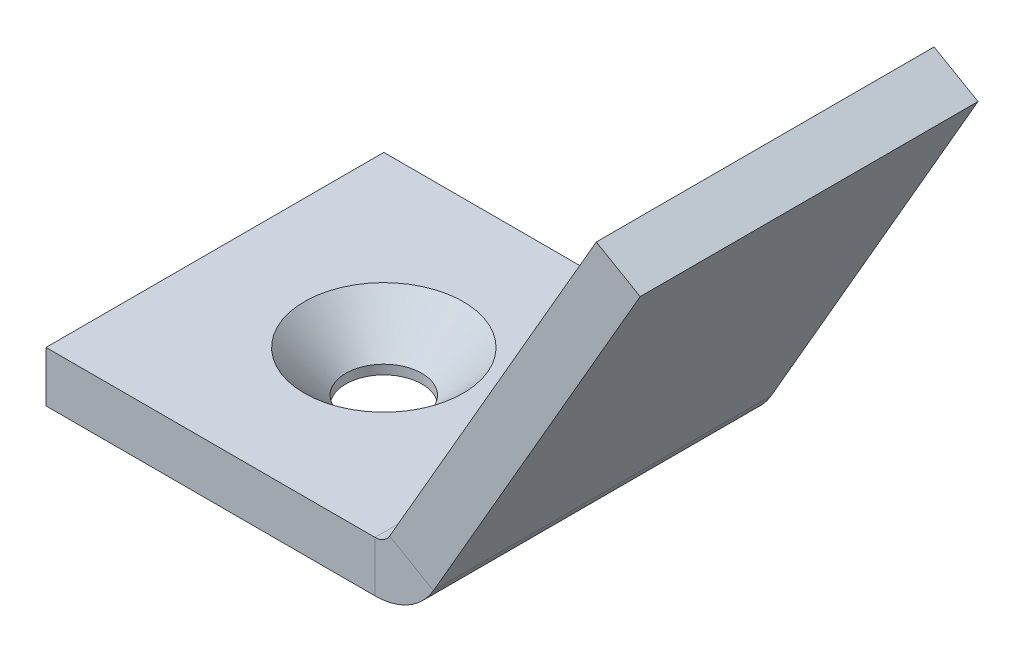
ISO-10303-21;
HEADER;
FILE_DESCRIPTION(('STEP AP214'),'2;1');
FILE_NAME('part.step','',(''),(''),'','','');
FILE_SCHEMA(('AUTOMOTIVE_DESIGN { 1 0 10303 214 1 1 1 1 }'));
ENDSEC;
DATA;
#1=APPLICATION_CONTEXT('core data for automotive mechanical design processes');
#2=APPLICATION_PROTOCOL_DEFINITION('international standard','automotive_design',2000,#1);
#3=PRODUCT_CONTEXT('',#1,'mechanical');
#4=PRODUCT('Part','Part','',(#3));
#5=PRODUCT_RELATED_PRODUCT_CATEGORY('part','',(#4));
#6=PRODUCT_DEFINITION_FORMATION('','',#4);
#7=PRODUCT_DEFINITION_CONTEXT('part definition',#1,'design');
#8=PRODUCT_DEFINITION('design','',#6,#7);
#9=PRODUCT_DEFINITION_SHAPE('','',#8);
#10=(LENGTH_UNIT() NAMED_UNIT(*) SI_UNIT(.MILLI.,.METRE.));
#11=(NAMED_UNIT(*) PLANE_ANGLE_UNIT() SI_UNIT($,.RADIAN.));
#12=(NAMED_UNIT(*) SI_UNIT($,.STERADIAN.) SOLID_ANGLE_UNIT());
#13=UNCERTAINTY_MEASURE_WITH_UNIT(LENGTH_MEASURE(1.E-05),#10,'distance_accuracy_value','');
#14=(GEOMETRIC_REPRESENTATION_CONTEXT(3) GLOBAL_UNCERTAINTY_ASSIGNED_CONTEXT((#13)) GLOBAL_UNIT_ASSIGNED_CONTEXT((#10,
#11,#12)) REPRESENTATION_CONTEXT('',''));
#15=CARTESIAN_POINT('',(0.,0.,0.));
#16=DIRECTION('',(0.,0.,1.));
#17=DIRECTION('',(1.,0.,0.));
#18=AXIS2_PLACEMENT_3D('',#15,#16,#17);
#19=CARTESIAN_POINT('',(10.0806036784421,-14.2739715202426,-20.));
#20=DIRECTION('',(0.86602540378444,-0.499999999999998,0.));
#21=DIRECTION('',(0.,0.,-1.));
#22=AXIS2_PLACEMENT_3D('',#19,#20,#21);
#23=PLANE('',#22);
#24=DIRECTION('',(-0.499999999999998,-0.86602540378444,0.));
#25=VECTOR('',#24,1.);
#26=CARTESIAN_POINT('',(10.0806036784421,-14.2739715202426,-20.));
#27=LINE('',#26,#25);
#28=CARTESIAN_POINT('',(32.580603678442,24.6971716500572,-20.));
#29=VERTEX_POINT('',#28);
#30=CARTESIAN_POINT('',(20.3424109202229,3.5,-20.));
#31=VERTEX_POINT('',#30);
#32=EDGE_CURVE('E41',#29,#31,#27,.T.);
#33=ORIENTED_EDGE('',*,*,#32,.T.);
#34=DIRECTION('',(0.,0.,1.));
#35=VECTOR('',#34,1.);
#36=CARTESIAN_POINT('',(20.3424109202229,3.50000000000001,-20.));
#37=LINE('',#36,#35);
#38=CARTESIAN_POINT('',(20.3424109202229,3.49999999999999,0.));
#39=VERTEX_POINT('',#38);
#40=EDGE_CURVE('E103',#31,#39,#37,.T.);
#41=ORIENTED_EDGE('',*,*,#40,.T.);
#42=DIRECTION('',(0.499999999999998,0.86602540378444,0.));
#43=VECTOR('',#42,1.);
#44=CARTESIAN_POINT('',(10.0806036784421,-14.2739715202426,0.));
#45=LINE('',#44,#43);
#46=CARTESIAN_POINT('',(32.580603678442,24.6971716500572,0.));
#47=VERTEX_POINT('',#46);
#48=EDGE_CURVE('E95',#39,#47,#45,.T.);
#49=ORIENTED_EDGE('',*,*,#48,.T.);
#50=DIRECTION('',(0.,0.,-1.));
#51=VECTOR('',#50,1.);
#52=CARTESIAN_POINT('',(32.580603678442,24.6971716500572,0.));
#53=LINE('',#52,#51);
#54=EDGE_CURVE('E62',#47,#29,#53,.T.);
#55=ORIENTED_EDGE('',*,*,#54,.T.);
#56=EDGE_LOOP('',(#33,#41,#49,#55));
#57=FACE_BOUND('',#56,.T.);
#58=ADVANCED_FACE('F37',(#57),#23,.F.);
#59=CARTESIAN_POINT('',(10.0806036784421,-14.2739715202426,-20.));
#60=DIRECTION('',(0.,0.,1.));
#61=DIRECTION('',(0.499999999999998,0.86602540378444,0.));
#62=AXIS2_PLACEMENT_3D('',#59,#60,#61);
#63=PLANE('',#62);
#64=DIRECTION('',(-0.499999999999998,-0.86602540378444,0.));
#65=VECTOR('',#64,1.);
#66=CARTESIAN_POINT('',(12.6786798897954,-15.7739715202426,-20.));
#67=LINE('',#66,#65);
#68=CARTESIAN_POINT('',(35.1786798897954,23.1971716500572,-20.));
#69=VERTEX_POINT('',#68);
#70=CARTESIAN_POINT('',(22.9404871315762,2.,-20.));
#71=VERTEX_POINT('',#70);
#72=EDGE_CURVE('E85',#69,#71,#67,.T.);
#73=ORIENTED_EDGE('',*,*,#72,.T.);
#74=DIRECTION('',(-0.86602540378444,0.499999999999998,0.));
#75=VECTOR('',#74,1.);
#76=CARTESIAN_POINT('',(20.3424109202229,3.50000000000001,-20.));
#77=LINE('',#76,#75);
#78=EDGE_CURVE('E101',#71,#31,#77,.T.);
#79=ORIENTED_EDGE('',*,*,#78,.T.);
#80=ORIENTED_EDGE('',*,*,#32,.F.);
#81=DIRECTION('',(0.86602540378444,-0.499999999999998,0.));
#82=VECTOR('',#81,1.);
#83=CARTESIAN_POINT('',(32.580603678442,24.6971716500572,-20.));
#84=LINE('',#83,#82);
#85=EDGE_CURVE('E78',#29,#69,#84,.T.);
#86=ORIENTED_EDGE('',*,*,#85,.T.);
#87=EDGE_LOOP('',(#73,#79,#80,#86));
#88=FACE_BOUND('',#87,.T.);
#89=ADVANCED_FACE('F90',(#88),#63,.F.);
#90=CARTESIAN_POINT('',(10.0806036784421,-14.2739715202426,0.));
#91=DIRECTION('',(0.,0.,-1.));
#92=DIRECTION('',(-0.499999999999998,-0.86602540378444,0.));
#93=AXIS2_PLACEMENT_3D('',#90,#91,#92);
#94=PLANE('',#93);
#95=ORIENTED_EDGE('',*,*,#48,.F.);
#96=DIRECTION('',(0.86602540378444,-0.499999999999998,0.));
#97=VECTOR('',#96,1.);
#98=CARTESIAN_POINT('',(20.3424109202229,3.50000000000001,0.));
#99=LINE('',#98,#97);
#100=CARTESIAN_POINT('',(22.9404871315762,2.00000000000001,0.));
#101=VERTEX_POINT('',#100);
#102=EDGE_CURVE('E12',#39,#101,#99,.T.);
#103=ORIENTED_EDGE('',*,*,#102,.T.);
#104=DIRECTION('',(0.499999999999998,0.86602540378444,0.));
#105=VECTOR('',#104,1.);
#106=CARTESIAN_POINT('',(12.6786798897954,-15.7739715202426,0.));
#107=LINE('',#106,#105);
#108=CARTESIAN_POINT('',(35.1786798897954,23.1971716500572,0.));
#109=VERTEX_POINT('',#108);
#110=EDGE_CURVE('E86',#101,#109,#107,.T.);
#111=ORIENTED_EDGE('',*,*,#110,.T.);
#112=DIRECTION('',(0.86602540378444,-0.499999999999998,0.));
#113=VECTOR('',#112,1.);
#114=CARTESIAN_POINT('',(32.580603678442,24.6971716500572,0.));
#115=LINE('',#114,#113);
#116=EDGE_CURVE('E81',#47,#109,#115,.T.);
#117=ORIENTED_EDGE('',*,*,#116,.F.);
#118=EDGE_LOOP('',(#95,#103,#111,#117));
#119=FACE_BOUND('',#118,.T.);
#120=ADVANCED_FACE('F39',(#119),#94,.F.);
#121=CARTESIAN_POINT('',(12.6786798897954,-15.7739715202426,-20.));
#122=DIRECTION('',(0.86602540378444,-0.499999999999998,0.));
#123=DIRECTION('',(0.,0.,-1.));
#124=AXIS2_PLACEMENT_3D('',#121,#122,#123);
#125=PLANE('',#124);
#126=DIRECTION('',(0.,0.,1.));
#127=VECTOR('',#126,1.);
#128=CARTESIAN_POINT('',(22.9404871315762,2.00000000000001,-20.));
#129=LINE('',#128,#127);
#130=EDGE_CURVE('E46',#71,#101,#129,.T.);
#131=ORIENTED_EDGE('',*,*,#130,.F.);
#132=ORIENTED_EDGE('',*,*,#72,.F.);
#133=DIRECTION('',(0.,0.,-1.));
#134=VECTOR('',#133,1.);
#135=CARTESIAN_POINT('',(35.1786798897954,23.1971716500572,0.));
#136=LINE('',#135,#134);
#137=EDGE_CURVE('E75',#109,#69,#136,.T.);
#138=ORIENTED_EDGE('',*,*,#137,.F.);
#139=ORIENTED_EDGE('',*,*,#110,.F.);
#140=EDGE_LOOP('',(#131,#132,#138,#139));
#141=FACE_BOUND('',#140,.T.);
#142=ADVANCED_FACE('F94',(#141),#125,.T.);
#143=CARTESIAN_POINT('',(32.580603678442,24.6971716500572,0.));
#144=DIRECTION('',(-0.499999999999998,-0.86602540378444,0.));
#145=DIRECTION('',(0.,0.,1.));
#146=AXIS2_PLACEMENT_3D('',#143,#144,#145);
#147=PLANE('',#146);
#148=ORIENTED_EDGE('',*,*,#137,.T.);
#149=ORIENTED_EDGE('',*,*,#85,.F.);
#150=ORIENTED_EDGE('',*,*,#54,.F.);
#151=ORIENTED_EDGE('',*,*,#116,.T.);
#152=EDGE_LOOP('',(#148,#149,#150,#151));
#153=FACE_BOUND('',#152,.T.);
#154=ADVANCED_FACE('F77',(#153),#147,.F.);
#155=CARTESIAN_POINT('',(10.,3.,-10.));
#156=DIRECTION('',(0.,1.,0.));
#157=DIRECTION('',(0.,0.,1.));
#158=AXIS2_PLACEMENT_3D('',#155,#156,#157);
#159=CYLINDRICAL_SURFACE('',#158,2.24999999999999);
#160=CARTESIAN_POINT('',(10.,0.,-10.));
#161=DIRECTION('',(0.,1.,0.));
#162=DIRECTION('',(0.,0.,1.));
#163=AXIS2_PLACEMENT_3D('',#160,#161,#162);
#164=CIRCLE('',#163,2.25);
#165=CARTESIAN_POINT('',(10.,0.,-7.75000000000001));
#166=VERTEX_POINT('',#165);
#167=EDGE_CURVE('E142',#166,#166,#164,.T.);
#168=ORIENTED_EDGE('',*,*,#167,.F.);
#169=EDGE_LOOP('',(#168));
#170=FACE_BOUND('',#169,.T.);
#171=CARTESIAN_POINT('',(10.,0.549999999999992,-10.));
#172=DIRECTION('',(0.,1.,0.));
#173=DIRECTION('',(0.,0.,1.));
#174=AXIS2_PLACEMENT_3D('',#171,#172,#173);
#175=CIRCLE('',#174,2.24999999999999);
#176=CARTESIAN_POINT('',(10.,0.549999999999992,-7.75000000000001));
#177=VERTEX_POINT('',#176);
#178=EDGE_CURVE('E118',#177,#177,#175,.T.);
#179=ORIENTED_EDGE('',*,*,#178,.T.);
#180=EDGE_LOOP('',(#179));
#181=FACE_BOUND('',#180,.T.);
#182=ADVANCED_FACE('F224',(#170,#181),#159,.F.);
#183=CARTESIAN_POINT('',(10.,3.,-10.));
#184=DIRECTION('',(0.,1.,0.));
#185=DIRECTION('',(0.,0.,1.));
#186=AXIS2_PLACEMENT_3D('',#183,#184,#185);
#187=CONICAL_SURFACE('',#186,4.7,0.785398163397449);
#188=ORIENTED_EDGE('',*,*,#178,.F.);
#189=EDGE_LOOP('',(#188));
#190=FACE_BOUND('',#189,.T.);
#191=CARTESIAN_POINT('',(10.,3.,-10.));
#192=DIRECTION('',(0.,1.,0.));
#193=DIRECTION('',(0.,0.,1.));
#194=AXIS2_PLACEMENT_3D('',#191,#192,#193);
#195=CIRCLE('',#194,4.7);
#196=CARTESIAN_POINT('',(10.,3.,-5.3));
#197=VERTEX_POINT('',#196);
#198=EDGE_CURVE('E121',#197,#197,#195,.T.);
#199=ORIENTED_EDGE('',*,*,#198,.T.);
#200=EDGE_LOOP('',(#199));
#201=FACE_BOUND('',#200,.T.);
#202=ADVANCED_FACE('F217',(#190,#201),#187,.F.);
#203=CARTESIAN_POINT('',(0.,3.,0.));
#204=DIRECTION('',(1.,0.,0.));
#205=DIRECTION('',(0.,0.,-1.));
#206=AXIS2_PLACEMENT_3D('',#203,#204,#205);
#207=PLANE('',#206);
#208=DIRECTION('',(0.,0.,1.));
#209=VECTOR('',#208,1.);
#210=CARTESIAN_POINT('',(0.,0.,0.));
#211=LINE('',#210,#209);
#212=CARTESIAN_POINT('',(0.,0.,-20.));
#213=VERTEX_POINT('',#212);
#214=CARTESIAN_POINT('',(0.,0.,0.));
#215=VERTEX_POINT('',#214);
#216=EDGE_CURVE('E124',#213,#215,#211,.T.);
#217=ORIENTED_EDGE('',*,*,#216,.T.);
#218=DIRECTION('',(0.,-1.,0.));
#219=VECTOR('',#218,1.);
#220=CARTESIAN_POINT('',(0.,3.,0.));
#221=LINE('',#220,#219);
#222=CARTESIAN_POINT('',(0.,3.,0.));
#223=VERTEX_POINT('',#222);
#224=EDGE_CURVE('E148',#223,#215,#221,.T.);
#225=ORIENTED_EDGE('',*,*,#224,.F.);
#226=DIRECTION('',(0.,0.,1.));
#227=VECTOR('',#226,1.);
#228=CARTESIAN_POINT('',(0.,3.,0.));
#229=LINE('',#228,#227);
#230=CARTESIAN_POINT('',(0.,3.,-20.));
#231=VERTEX_POINT('',#230);
#232=EDGE_CURVE('E133',#231,#223,#229,.T.);
#233=ORIENTED_EDGE('',*,*,#232,.F.);
#234=DIRECTION('',(0.,-1.,0.));
#235=VECTOR('',#234,1.);
#236=CARTESIAN_POINT('',(0.,3.,-20.));
#237=LINE('',#236,#235);
#238=EDGE_CURVE('E127',#231,#213,#237,.T.);
#239=ORIENTED_EDGE('',*,*,#238,.T.);
#240=EDGE_LOOP('',(#217,#225,#233,#239));
#241=FACE_BOUND('',#240,.T.);
#242=ADVANCED_FACE('F215',(#241),#207,.F.);
#243=CARTESIAN_POINT('',(0.,3.,-20.));
#244=DIRECTION('',(0.,-1.,0.));
#245=DIRECTION('',(0.,0.,-1.));
#246=AXIS2_PLACEMENT_3D('',#243,#244,#245);
#247=PLANE('',#246);
#248=DIRECTION('',(0.,0.,1.));
#249=VECTOR('',#248,1.);
#250=CARTESIAN_POINT('',(19.4763855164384,3.,-20.));
#251=LINE('',#250,#249);
#252=CARTESIAN_POINT('',(19.4763855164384,3.,-20.));
#253=VERTEX_POINT('',#252);
#254=CARTESIAN_POINT('',(19.4763855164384,3.,0.));
#255=VERTEX_POINT('',#254);
#256=EDGE_CURVE('E108',#253,#255,#251,.T.);
#257=ORIENTED_EDGE('',*,*,#256,.F.);
#258=DIRECTION('',(-1.,0.,0.));
#259=VECTOR('',#258,1.);
#260=CARTESIAN_POINT('',(0.,3.,-20.));
#261=LINE('',#260,#259);
#262=EDGE_CURVE('E130',#253,#231,#261,.T.);
#263=ORIENTED_EDGE('',*,*,#262,.T.);
#264=ORIENTED_EDGE('',*,*,#232,.T.);
#265=DIRECTION('',(1.,0.,0.));
#266=VECTOR('',#265,1.);
#267=CARTESIAN_POINT('',(0.,3.,0.));
#268=LINE('',#267,#266);
#269=EDGE_CURVE('E136',#223,#255,#268,.T.);
#270=ORIENTED_EDGE('',*,*,#269,.T.);
#271=EDGE_LOOP('',(#257,#263,#264,#270));
#272=FACE_BOUND('',#271,.T.);
#273=ORIENTED_EDGE('',*,*,#198,.F.);
#274=EDGE_LOOP('',(#273));
#275=FACE_BOUND('',#274,.T.);
#276=ADVANCED_FACE('F198',(#272,#275),#247,.F.);
#277=CARTESIAN_POINT('',(0.,3.,-20.));
#278=DIRECTION('',(0.,0.,1.));
#279=DIRECTION('',(1.,0.,0.));
#280=AXIS2_PLACEMENT_3D('',#277,#278,#279);
#281=PLANE('',#280);
#282=DIRECTION('',(0.,1.,0.));
#283=VECTOR('',#282,1.);
#284=CARTESIAN_POINT('',(19.4763855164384,3.,-20.));
#285=LINE('',#284,#283);
#286=CARTESIAN_POINT('',(19.4763855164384,0.,-20.));
#287=VERTEX_POINT('',#286);
#288=EDGE_CURVE('E115',#287,#253,#285,.T.);
#289=ORIENTED_EDGE('',*,*,#288,.F.);
#290=DIRECTION('',(-1.,0.,0.));
#291=VECTOR('',#290,1.);
#292=CARTESIAN_POINT('',(0.,0.,-20.));
#293=LINE('',#292,#291);
#294=EDGE_CURVE('E139',#287,#213,#293,.T.);
#295=ORIENTED_EDGE('',*,*,#294,.T.);
#296=ORIENTED_EDGE('',*,*,#238,.F.);
#297=ORIENTED_EDGE('',*,*,#262,.F.);
#298=EDGE_LOOP('',(#289,#295,#296,#297));
#299=FACE_BOUND('',#298,.T.);
#300=ADVANCED_FACE('F213',(#299),#281,.F.);
#301=CARTESIAN_POINT('',(0.,0.,-20.));
#302=DIRECTION('',(0.,-1.,0.));
#303=DIRECTION('',(0.,0.,-1.));
#304=AXIS2_PLACEMENT_3D('',#301,#302,#303);
#305=PLANE('',#304);
#306=ORIENTED_EDGE('',*,*,#167,.T.);
#307=EDGE_LOOP('',(#306));
#308=FACE_BOUND('',#307,.T.);
#309=ORIENTED_EDGE('',*,*,#294,.F.);
#310=DIRECTION('',(0.,0.,1.));
#311=VECTOR('',#310,1.);
#312=CARTESIAN_POINT('',(19.4763855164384,0.,-20.));
#313=LINE('',#312,#311);
#314=CARTESIAN_POINT('',(19.4763855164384,0.,0.));
#315=VERTEX_POINT('',#314);
#316=EDGE_CURVE('E145',#287,#315,#313,.T.);
#317=ORIENTED_EDGE('',*,*,#316,.T.);
#318=DIRECTION('',(1.,0.,0.));
#319=VECTOR('',#318,1.);
#320=CARTESIAN_POINT('',(0.,0.,0.));
#321=LINE('',#320,#319);
#322=EDGE_CURVE('E98',#215,#315,#321,.T.);
#323=ORIENTED_EDGE('',*,*,#322,.F.);
#324=ORIENTED_EDGE('',*,*,#216,.F.);
#325=EDGE_LOOP('',(#309,#317,#323,#324));
#326=FACE_BOUND('',#325,.T.);
#327=ADVANCED_FACE('F209',(#308,#326),#305,.T.);
#328=CARTESIAN_POINT('',(0.,3.,0.));
#329=DIRECTION('',(0.,0.,-1.));
#330=DIRECTION('',(-1.,0.,0.));
#331=AXIS2_PLACEMENT_3D('',#328,#329,#330);
#332=PLANE('',#331);
#333=DIRECTION('',(0.,-1.,0.));
#334=VECTOR('',#333,1.);
#335=CARTESIAN_POINT('',(19.4763855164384,3.,0.));
#336=LINE('',#335,#334);
#337=EDGE_CURVE('E111',#255,#315,#336,.T.);
#338=ORIENTED_EDGE('',*,*,#337,.F.);
#339=ORIENTED_EDGE('',*,*,#269,.F.);
#340=ORIENTED_EDGE('',*,*,#224,.T.);
#341=ORIENTED_EDGE('',*,*,#322,.T.);
#342=EDGE_LOOP('',(#338,#339,#340,#341));
#343=FACE_BOUND('',#342,.T.);
#344=ADVANCED_FACE('F203',(#343),#332,.F.);
#345=CARTESIAN_POINT('',(19.4763855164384,4.,-20.));
#346=DIRECTION('',(0.,0.,1.));
#347=DIRECTION('',(1.,0.,0.));
#348=AXIS2_PLACEMENT_3D('',#345,#346,#347);
#349=PLANE('',#348);
#350=ORIENTED_EDGE('',*,*,#78,.F.);
#351=CARTESIAN_POINT('',(19.4763855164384,4.,-20.));
#352=DIRECTION('',(0.,0.,-1.));
#353=DIRECTION('',(-1.,0.,0.));
#354=AXIS2_PLACEMENT_3D('',#351,#352,#353);
#355=CIRCLE('',#354,4.);
#356=EDGE_CURVE('E153',#71,#287,#355,.T.);
#357=ORIENTED_EDGE('',*,*,#356,.T.);
#358=ORIENTED_EDGE('',*,*,#288,.T.);
#359=CARTESIAN_POINT('',(19.4763855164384,4.,-20.));
#360=DIRECTION('',(0.,0.,-1.));
#361=DIRECTION('',(-1.,0.,0.));
#362=AXIS2_PLACEMENT_3D('',#359,#360,#361);
#363=CIRCLE('',#362,1.);
#364=EDGE_CURVE('E158',#31,#253,#363,.T.);
#365=ORIENTED_EDGE('',*,*,#364,.F.);
#366=EDGE_LOOP('',(#350,#357,#358,#365));
#367=FACE_BOUND('',#366,.T.);
#368=ADVANCED_FACE('F176',(#367),#349,.F.);
#369=CARTESIAN_POINT('',(19.4763855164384,4.,0.));
#370=DIRECTION('',(0.,0.,-1.));
#371=DIRECTION('',(-1.,0.,0.));
#372=AXIS2_PLACEMENT_3D('',#369,#370,#371);
#373=PLANE('',#372);
#374=ORIENTED_EDGE('',*,*,#337,.T.);
#375=CARTESIAN_POINT('',(19.4763855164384,4.,0.));
#376=DIRECTION('',(0.,0.,-1.));
#377=DIRECTION('',(-1.,0.,0.));
#378=AXIS2_PLACEMENT_3D('',#375,#376,#377);
#379=CIRCLE('',#378,4.);
#380=EDGE_CURVE('E156',#315,#101,#379,.F.);
#381=ORIENTED_EDGE('',*,*,#380,.T.);
#382=ORIENTED_EDGE('',*,*,#102,.F.);
#383=CARTESIAN_POINT('',(19.4763855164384,4.,0.));
#384=DIRECTION('',(0.,0.,1.));
#385=DIRECTION('',(1.,0.,0.));
#386=AXIS2_PLACEMENT_3D('',#383,#384,#385);
#387=CIRCLE('',#386,1.);
#388=EDGE_CURVE('E112',#255,#39,#387,.T.);
#389=ORIENTED_EDGE('',*,*,#388,.F.);
#390=EDGE_LOOP('',(#374,#381,#382,#389));
#391=FACE_BOUND('',#390,.T.);
#392=ADVANCED_FACE('F205',(#391),#373,.F.);
#393=CARTESIAN_POINT('',(19.4763855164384,4.,10.2508441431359));
#394=DIRECTION('',(0.,0.,-1.));
#395=DIRECTION('',(-1.,0.,0.));
#396=AXIS2_PLACEMENT_3D('',#393,#394,#395);
#397=CYLINDRICAL_SURFACE('',#396,1.);
#398=ORIENTED_EDGE('',*,*,#388,.T.);
#399=ORIENTED_EDGE('',*,*,#40,.F.);
#400=ORIENTED_EDGE('',*,*,#364,.T.);
#401=ORIENTED_EDGE('',*,*,#256,.T.);
#402=EDGE_LOOP('',(#398,#399,#400,#401));
#403=FACE_BOUND('',#402,.T.);
#404=ADVANCED_FACE('F166',(#403),#397,.F.);
#405=CARTESIAN_POINT('',(19.4763855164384,4.,10.2508441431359));
#406=DIRECTION('',(0.,0.,-1.));
#407=DIRECTION('',(-1.,0.,0.));
#408=AXIS2_PLACEMENT_3D('',#405,#406,#407);
#409=CYLINDRICAL_SURFACE('',#408,4.);
#410=ORIENTED_EDGE('',*,*,#380,.F.);
#411=ORIENTED_EDGE('',*,*,#316,.F.);
#412=ORIENTED_EDGE('',*,*,#356,.F.);
#413=ORIENTED_EDGE('',*,*,#130,.T.);
#414=EDGE_LOOP('',(#410,#411,#412,#413));
#415=FACE_BOUND('',#414,.T.);
#416=ADVANCED_FACE('F207',(#415),#409,.T.);
#417=CLOSED_SHELL('',(#58,#89,#120,#142,#154,#182,#202,#242,#276,#300,#327,#344,#368,#392,#404,#416));
#418=MANIFOLD_SOLID_BREP('B2',#417);
#419=ADVANCED_BREP_SHAPE_REPRESENTATION('',(#18,#418),#14);
#420=SHAPE_DEFINITION_REPRESENTATION(#9,#419);
ENDSEC;
END-ISO-10303-21;
